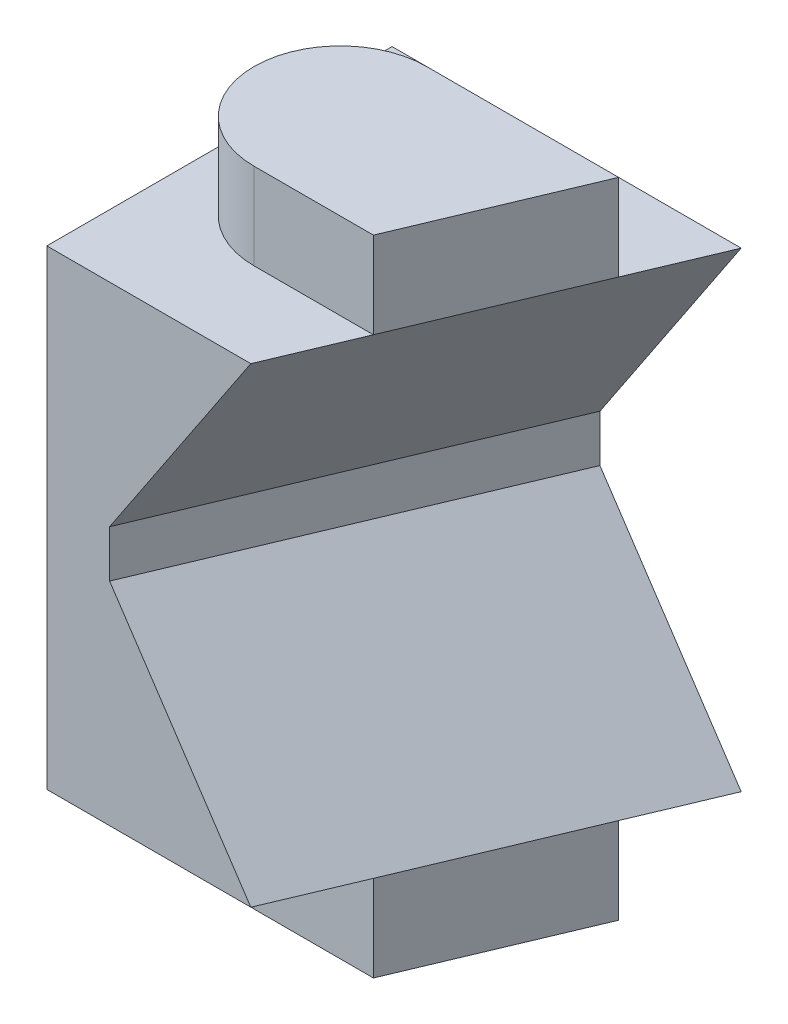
ISO-10303-21;
HEADER;
FILE_DESCRIPTION(('STEP AP214'),'2;1');
FILE_NAME('part.step','',(''),(''),'','','');
FILE_SCHEMA(('AUTOMOTIVE_DESIGN { 1 0 10303 214 1 1 1 1 }'));
ENDSEC;
DATA;
#1=APPLICATION_CONTEXT('core data for automotive mechanical design processes');
#2=APPLICATION_PROTOCOL_DEFINITION('international standard','automotive_design',2000,#1);
#3=PRODUCT_CONTEXT('',#1,'mechanical');
#4=PRODUCT('Part','Part','',(#3));
#5=PRODUCT_RELATED_PRODUCT_CATEGORY('part','',(#4));
#6=PRODUCT_DEFINITION_FORMATION('','',#4);
#7=PRODUCT_DEFINITION_CONTEXT('part definition',#1,'design');
#8=PRODUCT_DEFINITION('design','',#6,#7);
#9=PRODUCT_DEFINITION_SHAPE('','',#8);
#10=(LENGTH_UNIT() NAMED_UNIT(*) SI_UNIT(.MILLI.,.METRE.));
#11=(NAMED_UNIT(*) PLANE_ANGLE_UNIT() SI_UNIT($,.RADIAN.));
#12=(NAMED_UNIT(*) SI_UNIT($,.STERADIAN.) SOLID_ANGLE_UNIT());
#13=UNCERTAINTY_MEASURE_WITH_UNIT(LENGTH_MEASURE(1.E-05),#10,'distance_accuracy_value','');
#14=(GEOMETRIC_REPRESENTATION_CONTEXT(3) GLOBAL_UNCERTAINTY_ASSIGNED_CONTEXT((#13)) GLOBAL_UNIT_ASSIGNED_CONTEXT((#10,
#11,#12)) REPRESENTATION_CONTEXT('',''));
#15=CARTESIAN_POINT('',(0.,0.,0.));
#16=DIRECTION('',(0.,0.,1.));
#17=DIRECTION('',(1.,0.,0.));
#18=AXIS2_PLACEMENT_3D('',#15,#16,#17);
#19=CARTESIAN_POINT('',(12.9999999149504,-15.0000000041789,22.0000000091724));
#20=DIRECTION('',(0.785395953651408,0.523597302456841,0.330150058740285));
#21=DIRECTION('',(-0.554700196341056,0.832050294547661,-4.39613269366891E-13));
#22=AXIS2_PLACEMENT_3D('',#19,#20,#21);
#23=PLANE('',#22);
#24=CARTESIAN_POINT('',(12.9999999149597,-15.0000000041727,22.0000000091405));
#25=CARTESIAN_POINT('',(3.99999991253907,-1.50000000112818,22.0000000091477));
#26=B_SPLINE_CURVE_WITH_KNOTS('',1,(#24,#25),.UNSPECIFIED.,.F.,.F.,(2,2),(0.,1.),.UNSPECIFIED.);
#27=CARTESIAN_POINT('',(12.9999999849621,-15.0000000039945,21.9999998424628));
#28=VERTEX_POINT('',#27);
#29=CARTESIAN_POINT('',(4.00000000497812,-1.5000001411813,22.0000000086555));
#30=VERTEX_POINT('',#29);
#31=EDGE_CURVE('E235',#28,#30,#26,.T.);
#32=ORIENTED_EDGE('',*,*,#31,.F.);
#33=CARTESIAN_POINT('',(15.3119870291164,-15.0000000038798,16.5000000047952));
#34=CARTESIAN_POINT('',(12.9999999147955,-15.0000000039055,22.0000000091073));
#35=B_SPLINE_CURVE_WITH_KNOTS('',1,(#33,#34),.UNSPECIFIED.,.F.,.F.,(2,2),(0.,1.),.UNSPECIFIED.);
#36=CARTESIAN_POINT('',(15.3119870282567,-15.0000000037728,16.5000000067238));
#37=VERTEX_POINT('',#36);
#38=EDGE_CURVE('E183',#37,#28,#35,.T.);
#39=ORIENTED_EDGE('',*,*,#38,.F.);
#40=CARTESIAN_POINT('',(19.935961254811,-15.0000000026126,5.50000000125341));
#41=CARTESIAN_POINT('',(15.3119870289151,-15.0000000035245,16.5000000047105));
#42=B_SPLINE_CURVE_WITH_KNOTS('',1,(#40,#41),.UNSPECIFIED.,.F.,.F.,(2,2),(0.,1.),.UNSPECIFIED.);
#43=CARTESIAN_POINT('',(19.935961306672,-15.0000000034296,5.49999987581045));
#44=VERTEX_POINT('',#43);
#45=EDGE_CURVE('E214',#44,#37,#42,.T.);
#46=ORIENTED_EDGE('',*,*,#45,.F.);
#47=CARTESIAN_POINT('',(22.2479483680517,-15.0000000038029,1.43913809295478E-09));
#48=CARTESIAN_POINT('',(19.9359612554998,-15.0000000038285,5.50000000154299));
#49=B_SPLINE_CURVE_WITH_KNOTS('',1,(#47,#48),.UNSPECIFIED.,.F.,.F.,(2,2),(0.,1.),.UNSPECIFIED.);
#50=CARTESIAN_POINT('',(22.2479483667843,-15.0000000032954,4.64677502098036E-10));
#51=VERTEX_POINT('',#50);
#52=EDGE_CURVE('E33',#51,#44,#49,.T.);
#53=ORIENTED_EDGE('',*,*,#52,.F.);
#54=CARTESIAN_POINT('',(22.2479483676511,-15.0000000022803,-2.25523637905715E-11));
#55=CARTESIAN_POINT('',(13.2479483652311,-1.49999999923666,-1.54204042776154E-11));
#56=B_SPLINE_CURVE_WITH_KNOTS('',1,(#54,#55),.UNSPECIFIED.,.F.,.F.,(2,2),(0.,1.),.UNSPECIFIED.);
#57=CARTESIAN_POINT('',(13.2479483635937,-1.49999969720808,-9.59917629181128E-12));
#58=VERTEX_POINT('',#57);
#59=EDGE_CURVE('E240',#51,#58,#56,.T.);
#60=ORIENTED_EDGE('',*,*,#59,.T.);
#61=CARTESIAN_POINT('',(13.2479483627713,-1.49999999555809,2.04458569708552E-12));
#62=CARTESIAN_POINT('',(3.99999990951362,-1.49999999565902,22.0000000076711));
#63=B_SPLINE_CURVE_WITH_KNOTS('',1,(#61,#62),.UNSPECIFIED.,.F.,.F.,(2,2),(0.,1.),.UNSPECIFIED.);
#64=EDGE_CURVE('E233',#58,#30,#63,.T.);
#65=ORIENTED_EDGE('',*,*,#64,.T.);
#66=EDGE_LOOP('',(#32,#39,#46,#53,#60,#65));
#67=FACE_BOUND('',#66,.T.);
#68=ADVANCED_FACE('F14',(#67),#23,.T.);
#69=CARTESIAN_POINT('',(22.2479483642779,15.0000000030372,-7.48755097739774E-12));
#70=DIRECTION('',(0.785395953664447,-0.523597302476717,0.330150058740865));
#71=DIRECTION('',(0.554700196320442,0.83205029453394,-4.79190809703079E-13));
#72=AXIS2_PLACEMENT_3D('',#69,#70,#71);
#73=PLANE('',#72);
#74=CARTESIAN_POINT('',(19.9359612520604,15.0000000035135,5.50000000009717));
#75=CARTESIAN_POINT('',(22.2479483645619,15.0000000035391,1.12945883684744E-10));
#76=B_SPLINE_CURVE_WITH_KNOTS('',1,(#74,#75),.UNSPECIFIED.,.F.,.F.,(2,2),(0.,1.),.UNSPECIFIED.);
#77=CARTESIAN_POINT('',(19.9359611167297,15.0000000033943,5.5000000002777));
#78=VERTEX_POINT('',#77);
#79=CARTESIAN_POINT('',(22.2479482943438,15.0000000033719,1.66700320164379E-07));
#80=VERTEX_POINT('',#79);
#81=EDGE_CURVE('E109',#78,#80,#76,.T.);
#82=ORIENTED_EDGE('',*,*,#81,.F.);
#83=CARTESIAN_POINT('',(19.9359612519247,15.000000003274,5.50000000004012));
#84=CARTESIAN_POINT('',(15.3119870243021,15.0000000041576,16.5000000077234));
#85=B_SPLINE_CURVE_WITH_KNOTS('',1,(#83,#84),.UNSPECIFIED.,.F.,.F.,(2,2),(0.,1.),.UNSPECIFIED.);
#86=CARTESIAN_POINT('',(15.3119869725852,15.0000000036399,16.5000001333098));
#87=VERTEX_POINT('',#86);
#88=EDGE_CURVE('E102',#78,#87,#85,.T.);
#89=ORIENTED_EDGE('',*,*,#88,.T.);
#90=CARTESIAN_POINT('',(12.9999999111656,15.0000000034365,22.0000000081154));
#91=CARTESIAN_POINT('',(15.3119870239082,15.0000000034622,16.5000000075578));
#92=B_SPLINE_CURVE_WITH_KNOTS('',1,(#90,#91),.UNSPECIFIED.,.F.,.F.,(2,2),(0.,1.),.UNSPECIFIED.);
#93=CARTESIAN_POINT('',(12.9999999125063,15.0000000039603,22.0000000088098));
#94=VERTEX_POINT('',#93);
#95=EDGE_CURVE('E106',#94,#87,#92,.T.);
#96=ORIENTED_EDGE('',*,*,#95,.F.);
#97=CARTESIAN_POINT('',(12.9999999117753,15.0000000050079,22.0000000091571));
#98=CARTESIAN_POINT('',(3.99999990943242,1.50000000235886,22.0000000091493));
#99=B_SPLINE_CURVE_WITH_KNOTS('',1,(#97,#98),.UNSPECIFIED.,.F.,.F.,(2,2),(0.,1.),.UNSPECIFIED.);
#100=CARTESIAN_POINT('',(3.99999990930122,1.50000000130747,22.0000000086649));
#101=VERTEX_POINT('',#100);
#102=EDGE_CURVE('E263',#94,#101,#99,.T.);
#103=ORIENTED_EDGE('',*,*,#102,.T.);
#104=CARTESIAN_POINT('',(3.99999990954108,1.50000000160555,22.000000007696));
#105=CARTESIAN_POINT('',(13.2479483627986,1.50000000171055,2.74570762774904E-11));
#106=B_SPLINE_CURVE_WITH_KNOTS('',1,(#104,#105),.UNSPECIFIED.,.F.,.F.,(2,2),(0.,1.),.UNSPECIFIED.);
#107=CARTESIAN_POINT('',(13.2479485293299,1.50000025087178,0.));
#108=VERTEX_POINT('',#107);
#109=EDGE_CURVE('E155',#101,#108,#106,.T.);
#110=ORIENTED_EDGE('',*,*,#109,.T.);
#111=CARTESIAN_POINT('',(22.2479483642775,15.0000000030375,-5.99272950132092E-12));
#112=CARTESIAN_POINT('',(13.2479483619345,1.50000000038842,-1.37656614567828E-11));
#113=B_SPLINE_CURVE_WITH_KNOTS('',1,(#111,#112),.UNSPECIFIED.,.F.,.F.,(2,2),(0.,1.),.UNSPECIFIED.);
#114=EDGE_CURVE('E319',#80,#108,#113,.T.);
#115=ORIENTED_EDGE('',*,*,#114,.F.);
#116=EDGE_LOOP('',(#82,#89,#96,#103,#110,#115));
#117=FACE_BOUND('',#116,.T.);
#118=ADVANCED_FACE('F104',(#117),#73,.T.);
#119=CARTESIAN_POINT('',(7.70193844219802,20.5000000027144,11.0000000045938));
#120=DIRECTION('',(-1.24066867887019E-11,-1.,-5.52071956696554E-13));
#121=DIRECTION('',(1.,-1.24066867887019E-11,0.));
#122=AXIS2_PLACEMENT_3D('',#119,#120,#121);
#123=CYLINDRICAL_SURFACE('',#122,5.50000000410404);
#124=CARTESIAN_POINT('',(7.70193844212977,15.0000000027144,11.0000000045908));
#125=DIRECTION('',(-1.24066867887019E-11,-1.,-5.52071956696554E-13));
#126=DIRECTION('',(1.,-1.24066867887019E-11,0.));
#127=AXIS2_PLACEMENT_3D('',#124,#125,#126);
#128=CIRCLE('',#127,5.50000000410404);
#129=CARTESIAN_POINT('',(7.70193844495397,15.000000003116,16.5000000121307));
#130=VERTEX_POINT('',#129);
#131=CARTESIAN_POINT('',(7.70193844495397,15.0000000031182,5.50000000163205));
#132=VERTEX_POINT('',#131);
#133=EDGE_CURVE('E18',#130,#132,#128,.T.);
#134=ORIENTED_EDGE('',*,*,#133,.F.);
#135=DIRECTION('',(-1.24066867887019E-11,-1.,-5.52071956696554E-13));
#136=VECTOR('',#135,1.);
#137=CARTESIAN_POINT('',(7.70193844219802,20.5000000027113,16.5000000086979));
#138=LINE('',#137,#136);
#139=CARTESIAN_POINT('',(7.70193844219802,20.5000000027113,16.5000000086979));
#140=VERTEX_POINT('',#139);
#141=EDGE_CURVE('E133',#140,#130,#138,.T.);
#142=ORIENTED_EDGE('',*,*,#141,.F.);
#143=CARTESIAN_POINT('',(7.70193844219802,20.5000000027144,11.0000000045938));
#144=DIRECTION('',(-1.24066867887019E-11,-1.,-5.52071956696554E-13));
#145=DIRECTION('',(1.,-1.24066867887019E-11,0.));
#146=AXIS2_PLACEMENT_3D('',#143,#144,#145);
#147=CIRCLE('',#146,5.50000000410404);
#148=CARTESIAN_POINT('',(7.70193844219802,20.5000000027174,5.50000000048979));
#149=VERTEX_POINT('',#148);
#150=EDGE_CURVE('E162',#140,#149,#147,.T.);
#151=ORIENTED_EDGE('',*,*,#150,.T.);
#152=DIRECTION('',(-1.24066867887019E-11,-1.,-5.52071956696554E-13));
#153=VECTOR('',#152,1.);
#154=CARTESIAN_POINT('',(7.70193844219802,20.5000000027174,5.50000000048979));
#155=LINE('',#154,#153);
#156=EDGE_CURVE('E167',#149,#132,#155,.T.);
#157=ORIENTED_EDGE('',*,*,#156,.T.);
#158=EDGE_LOOP('',(#134,#142,#151,#157));
#159=FACE_BOUND('',#158,.T.);
#160=ADVANCED_FACE('F422',(#159),#123,.T.);
#161=CARTESIAN_POINT('',(7.70193844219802,20.5000000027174,5.50000000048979));
#162=DIRECTION('',(0.,5.52071956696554E-13,-1.));
#163=DIRECTION('',(0.,1.,5.52071956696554E-13));
#164=AXIS2_PLACEMENT_3D('',#161,#162,#163);
#165=PLANE('',#164);
#166=CARTESIAN_POINT('',(7.70193844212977,15.0000000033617,5.50000000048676));
#167=CARTESIAN_POINT('',(19.9359612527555,15.0000000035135,5.50000000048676));
#168=B_SPLINE_CURVE_WITH_KNOTS('',1,(#166,#167),.UNSPECIFIED.,.F.,.F.,(2,2),(0.,1.),.UNSPECIFIED.);
#169=EDGE_CURVE('E136',#132,#78,#168,.T.);
#170=ORIENTED_EDGE('',*,*,#169,.F.);
#171=ORIENTED_EDGE('',*,*,#156,.F.);
#172=DIRECTION('',(1.,-1.2406638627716E-11,0.));
#173=VECTOR('',#172,1.);
#174=CARTESIAN_POINT('',(7.70193844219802,20.5000000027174,5.50000000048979));
#175=LINE('',#174,#173);
#176=CARTESIAN_POINT('',(19.9359612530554,20.5000000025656,5.50000000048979));
#177=VERTEX_POINT('',#176);
#178=EDGE_CURVE('E168',#149,#177,#175,.T.);
#179=ORIENTED_EDGE('',*,*,#178,.T.);
#180=DIRECTION('',(-1.24066867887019E-11,-1.,-5.52071956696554E-13));
#181=VECTOR('',#180,1.);
#182=CARTESIAN_POINT('',(19.9359612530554,20.5000000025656,5.50000000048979));
#183=LINE('',#182,#181);
#184=EDGE_CURVE('E170',#177,#78,#183,.T.);
#185=ORIENTED_EDGE('',*,*,#184,.T.);
#186=EDGE_LOOP('',(#170,#171,#179,#185));
#187=FACE_BOUND('',#186,.T.);
#188=ADVANCED_FACE('F464',(#187),#165,.T.);
#189=CARTESIAN_POINT('',(15.3119870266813,20.500000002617,16.5000000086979));
#190=DIRECTION('',(0.921863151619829,-1.16512038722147E-11,0.387515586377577));
#191=DIRECTION('',(0.387515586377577,0.,-0.921863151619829));
#192=AXIS2_PLACEMENT_3D('',#189,#190,#191);
#193=PLANE('',#192);
#194=ORIENTED_EDGE('',*,*,#88,.F.);
#195=ORIENTED_EDGE('',*,*,#184,.F.);
#196=DIRECTION('',(-0.387515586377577,4.29873490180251E-12,0.921863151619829));
#197=VECTOR('',#196,1.);
#198=CARTESIAN_POINT('',(15.3119870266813,20.500000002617,16.5000000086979));
#199=LINE('',#198,#197);
#200=CARTESIAN_POINT('',(15.3119870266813,20.500000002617,16.5000000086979));
#201=VERTEX_POINT('',#200);
#202=EDGE_CURVE('E127',#177,#201,#199,.T.);
#203=ORIENTED_EDGE('',*,*,#202,.T.);
#204=DIRECTION('',(-1.24066867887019E-11,-1.,-5.52071956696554E-13));
#205=VECTOR('',#204,1.);
#206=CARTESIAN_POINT('',(15.3119870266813,20.500000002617,16.5000000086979));
#207=LINE('',#206,#205);
#208=EDGE_CURVE('E124',#201,#87,#207,.T.);
#209=ORIENTED_EDGE('',*,*,#208,.T.);
#210=EDGE_LOOP('',(#194,#195,#203,#209));
#211=FACE_BOUND('',#210,.T.);
#212=ADVANCED_FACE('F125',(#211),#193,.T.);
#213=CARTESIAN_POINT('',(7.70193844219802,20.5000000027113,16.5000000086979));
#214=DIRECTION('',(0.,-5.5207195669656E-13,1.));
#215=DIRECTION('',(0.,-1.,-5.5207195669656E-13));
#216=AXIS2_PLACEMENT_3D('',#213,#214,#215);
#217=PLANE('',#216);
#218=CARTESIAN_POINT('',(15.3119870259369,15.0000000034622,16.5000000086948));
#219=CARTESIAN_POINT('',(7.70193844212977,15.0000000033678,16.5000000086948));
#220=B_SPLINE_CURVE_WITH_KNOTS('',1,(#218,#219),.UNSPECIFIED.,.F.,.F.,(2,2),(0.,1.),.UNSPECIFIED.);
#221=EDGE_CURVE('E118',#87,#130,#220,.T.);
#222=ORIENTED_EDGE('',*,*,#221,.F.);
#223=ORIENTED_EDGE('',*,*,#208,.F.);
#224=DIRECTION('',(-1.,1.24067269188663E-11,0.));
#225=VECTOR('',#224,1.);
#226=CARTESIAN_POINT('',(7.70193844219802,20.5000000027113,16.5000000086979));
#227=LINE('',#226,#225);
#228=EDGE_CURVE('E113',#201,#140,#227,.T.);
#229=ORIENTED_EDGE('',*,*,#228,.T.);
#230=ORIENTED_EDGE('',*,*,#141,.T.);
#231=EDGE_LOOP('',(#222,#223,#229,#230));
#232=FACE_BOUND('',#231,.T.);
#233=ADVANCED_FACE('F132',(#232),#217,.T.);
#234=CARTESIAN_POINT('',(7.70193844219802,20.5000000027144,11.0000000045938));
#235=DIRECTION('',(1.24066867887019E-11,1.,5.52071956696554E-13));
#236=DIRECTION('',(1.,-1.24066867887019E-11,0.));
#237=AXIS2_PLACEMENT_3D('',#234,#235,#236);
#238=PLANE('',#237);
#239=ORIENTED_EDGE('',*,*,#150,.F.);
#240=ORIENTED_EDGE('',*,*,#228,.F.);
#241=ORIENTED_EDGE('',*,*,#202,.F.);
#242=ORIENTED_EDGE('',*,*,#178,.F.);
#243=EDGE_LOOP('',(#239,#240,#241,#242));
#244=FACE_BOUND('',#243,.T.);
#245=ADVANCED_FACE('F16',(#244),#238,.T.);
#246=CARTESIAN_POINT('',(1.99999991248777,15.0000000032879,-6.71425375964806E-12));
#247=DIRECTION('',(-1.24066867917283E-11,1.00000000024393,-5.52071956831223E-13));
#248=DIRECTION('',(0.,-5.52016445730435E-13,1.00000000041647));
#249=AXIS2_PLACEMENT_3D('',#246,#247,#248);
#250=PLANE('',#249);
#251=CARTESIAN_POINT('',(12.999999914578,15.0000000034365,22.0000000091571));
#252=CARTESIAN_POINT('',(-8.35194274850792E-08,15.0000000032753,22.0000000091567));
#253=B_SPLINE_CURVE_WITH_KNOTS('',1,(#251,#252),.UNSPECIFIED.,.F.,.F.,(2,2),(0.,1.),.UNSPECIFIED.);
#254=CARTESIAN_POINT('',(8.31472217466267E-08,15.0000000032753,22.0000000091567));
#255=VERTEX_POINT('',#254);
#256=EDGE_CURVE('E121',#94,#255,#253,.T.);
#257=ORIENTED_EDGE('',*,*,#256,.F.);
#258=ORIENTED_EDGE('',*,*,#95,.T.);
#259=ORIENTED_EDGE('',*,*,#221,.T.);
#260=ORIENTED_EDGE('',*,*,#133,.T.);
#261=ORIENTED_EDGE('',*,*,#169,.T.);
#262=ORIENTED_EDGE('',*,*,#81,.T.);
#263=CARTESIAN_POINT('',(22.2479483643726,15.0000000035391,-5.99272950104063E-12));
#264=CARTESIAN_POINT('',(-8.35194274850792E-08,15.0000000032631,-6.78552263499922E-12));
#265=B_SPLINE_CURVE_WITH_KNOTS('',1,(#263,#264),.UNSPECIFIED.,.F.,.F.,(2,2),(0.,1.),.UNSPECIFIED.);
#266=CARTESIAN_POINT('',(-8.35194274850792E-08,15.0000000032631,-6.77624178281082E-12));
#267=VERTEX_POINT('',#266);
#268=EDGE_CURVE('E311',#80,#267,#265,.T.);
#269=ORIENTED_EDGE('',*,*,#268,.T.);
#270=DIRECTION('',(0.,-5.52036320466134E-13,-1.));
#271=VECTOR('',#270,1.);
#272=CARTESIAN_POINT('',(-8.35194274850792E-08,15.0000000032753,22.0000000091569));
#273=LINE('',#272,#271);
#274=EDGE_CURVE('E306',#255,#267,#273,.T.);
#275=ORIENTED_EDGE('',*,*,#274,.F.);
#276=EDGE_LOOP('',(#257,#258,#259,#260,#261,#262,#269,#275));
#277=FACE_BOUND('',#276,.T.);
#278=ADVANCED_FACE('F116',(#277),#250,.T.);
#279=CARTESIAN_POINT('',(13.2479483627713,-1.50000000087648,2.04384873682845E-12));
#280=DIRECTION('',(-0.921863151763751,1.1651633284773E-11,-0.387515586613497));
#281=DIRECTION('',(-0.387515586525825,4.2988952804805E-12,0.921863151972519));
#282=AXIS2_PLACEMENT_3D('',#279,#280,#281);
#283=PLANE('',#282);
#284=CARTESIAN_POINT('',(3.99999990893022,1.499999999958,22.0000000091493));
#285=CARTESIAN_POINT('',(3.99999990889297,-1.50000000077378,22.0000000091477));
#286=B_SPLINE_CURVE_WITH_KNOTS('',1,(#284,#285),.UNSPECIFIED.,.F.,.F.,(2,2),(0.,1.),.UNSPECIFIED.);
#287=EDGE_CURVE('E256',#101,#30,#286,.T.);
#288=ORIENTED_EDGE('',*,*,#287,.T.);
#289=ORIENTED_EDGE('',*,*,#64,.F.);
#290=CARTESIAN_POINT('',(13.2479483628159,1.49999999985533,-1.37656614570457E-11));
#291=CARTESIAN_POINT('',(13.2479483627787,-1.50000000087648,-1.54217107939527E-11));
#292=B_SPLINE_CURVE_WITH_KNOTS('',1,(#290,#291),.UNSPECIFIED.,.F.,.F.,(2,2),(0.,1.),.UNSPECIFIED.);
#293=EDGE_CURVE('E291',#108,#58,#292,.T.);
#294=ORIENTED_EDGE('',*,*,#293,.F.);
#295=ORIENTED_EDGE('',*,*,#109,.F.);
#296=EDGE_LOOP('',(#288,#289,#294,#295));
#297=FACE_BOUND('',#296,.T.);
#298=ADVANCED_FACE('F381',(#297),#283,.F.);
#299=CARTESIAN_POINT('',(1.99999991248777,15.0000000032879,-6.71425375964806E-12));
#300=DIRECTION('',(0.,5.52016445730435E-13,-1.00000000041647));
#301=DIRECTION('',(-1.00000000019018,1.24070198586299E-11,0.));
#302=AXIS2_PLACEMENT_3D('',#299,#300,#301);
#303=PLANE('',#302);
#304=CARTESIAN_POINT('',(22.2479483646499,-15.0000000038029,-2.25532228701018E-11));
#305=CARTESIAN_POINT('',(-8.31472252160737E-08,-15.0000000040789,-2.3346016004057E-11));
#306=B_SPLINE_CURVE_WITH_KNOTS('',1,(#304,#305),.UNSPECIFIED.,.F.,.F.,(2,2),(0.,1.),.UNSPECIFIED.);
#307=CARTESIAN_POINT('',(8.35194240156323E-08,-15.0000000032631,-1.22781768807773E-11));
#308=VERTEX_POINT('',#307);
#309=EDGE_CURVE('E349',#51,#308,#306,.T.);
#310=ORIENTED_EDGE('',*,*,#309,.T.);
#311=CARTESIAN_POINT('',(-8.31472252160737E-08,-15.0000000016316,-2.33460160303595E-11));
#312=CARTESIAN_POINT('',(-8.35194274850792E-08,15.0000000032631,-6.7855226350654E-12));
#313=B_SPLINE_CURVE_WITH_KNOTS('',1,(#311,#312),.UNSPECIFIED.,.F.,.F.,(2,2),(0.,1.),.UNSPECIFIED.);
#314=EDGE_CURVE('E264',#308,#267,#313,.T.);
#315=ORIENTED_EDGE('',*,*,#314,.T.);
#316=ORIENTED_EDGE('',*,*,#268,.F.);
#317=ORIENTED_EDGE('',*,*,#114,.T.);
#318=ORIENTED_EDGE('',*,*,#293,.T.);
#319=ORIENTED_EDGE('',*,*,#59,.F.);
#320=EDGE_LOOP('',(#310,#315,#316,#317,#318,#319));
#321=FACE_BOUND('',#320,.T.);
#322=ADVANCED_FACE('F348',(#321),#303,.T.);
#323=CARTESIAN_POINT('',(6.99999991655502,11.0999999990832,11.0000000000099));
#324=DIRECTION('',(1.,0.,0.));
#325=DIRECTION('',(0.,0.,-1.));
#326=AXIS2_PLACEMENT_3D('',#323,#324,#325);
#327=PLANE('',#326);
#328=CARTESIAN_POINT('',(6.99999991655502,8.99999999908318,11.0000000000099));
#329=DIRECTION('',(-1.,0.,0.));
#330=DIRECTION('',(0.,0.,1.));
#331=AXIS2_PLACEMENT_3D('',#328,#329,#330);
#332=CIRCLE('',#331,2.5);
#333=CARTESIAN_POINT('',(6.99999991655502,8.99999999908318,13.5000000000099));
#334=VERTEX_POINT('',#333);
#335=EDGE_CURVE('E284',#334,#334,#332,.T.);
#336=ORIENTED_EDGE('',*,*,#335,.T.);
#337=EDGE_LOOP('',(#336));
#338=FACE_BOUND('',#337,.T.);
#339=ADVANCED_FACE('F430',(#338),#327,.F.);
#340=CARTESIAN_POINT('',(-8.34449766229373E-08,8.99999999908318,11.0000000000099));
#341=DIRECTION('',(-1.,0.,0.));
#342=DIRECTION('',(0.,0.,1.));
#343=AXIS2_PLACEMENT_3D('',#340,#341,#342);
#344=CYLINDRICAL_SURFACE('',#343,2.5);
#345=ORIENTED_EDGE('',*,*,#335,.F.);
#346=EDGE_LOOP('',(#345));
#347=FACE_BOUND('',#346,.T.);
#348=CARTESIAN_POINT('',(0.399999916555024,8.99999999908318,11.0000000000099));
#349=DIRECTION('',(-1.,0.,0.));
#350=DIRECTION('',(0.,0.,1.));
#351=AXIS2_PLACEMENT_3D('',#348,#349,#350);
#352=CIRCLE('',#351,2.5);
#353=CARTESIAN_POINT('',(0.399999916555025,8.99999999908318,13.5000000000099));
#354=VERTEX_POINT('',#353);
#355=EDGE_CURVE('E290',#354,#354,#352,.T.);
#356=ORIENTED_EDGE('',*,*,#355,.T.);
#357=EDGE_LOOP('',(#356));
#358=FACE_BOUND('',#357,.T.);
#359=ADVANCED_FACE('F433',(#347,#358),#344,.F.);
#360=CARTESIAN_POINT('',(6.99999991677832,-6.90000000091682,11.0000000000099));
#361=DIRECTION('',(1.,0.,0.));
#362=DIRECTION('',(0.,0.,-1.));
#363=AXIS2_PLACEMENT_3D('',#360,#361,#362);
#364=PLANE('',#363);
#365=CARTESIAN_POINT('',(6.99999991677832,-9.00000000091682,11.0000000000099));
#366=DIRECTION('',(-1.,0.,0.));
#367=DIRECTION('',(0.,0.,1.));
#368=AXIS2_PLACEMENT_3D('',#365,#366,#367);
#369=CIRCLE('',#368,2.5);
#370=CARTESIAN_POINT('',(6.99999991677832,-9.00000000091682,13.5000000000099));
#371=VERTEX_POINT('',#370);
#372=EDGE_CURVE('E294',#371,#371,#369,.T.);
#373=ORIENTED_EDGE('',*,*,#372,.T.);
#374=EDGE_LOOP('',(#373));
#375=FACE_BOUND('',#374,.T.);
#376=ADVANCED_FACE('F437',(#375),#364,.F.);
#377=CARTESIAN_POINT('',(-8.32216760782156E-08,-9.00000000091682,11.0000000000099));
#378=DIRECTION('',(-1.,0.,0.));
#379=DIRECTION('',(0.,0.,1.));
#380=AXIS2_PLACEMENT_3D('',#377,#378,#379);
#381=CYLINDRICAL_SURFACE('',#380,2.5);
#382=ORIENTED_EDGE('',*,*,#372,.F.);
#383=EDGE_LOOP('',(#382));
#384=FACE_BOUND('',#383,.T.);
#385=CARTESIAN_POINT('',(0.399999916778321,-9.00000000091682,11.0000000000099));
#386=DIRECTION('',(-1.,0.,0.));
#387=DIRECTION('',(0.,0.,1.));
#388=AXIS2_PLACEMENT_3D('',#385,#386,#387);
#389=CIRCLE('',#388,2.5);
#390=CARTESIAN_POINT('',(0.399999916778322,-9.00000000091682,13.5000000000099));
#391=VERTEX_POINT('',#390);
#392=EDGE_CURVE('E297',#391,#391,#389,.T.);
#393=ORIENTED_EDGE('',*,*,#392,.T.);
#394=EDGE_LOOP('',(#393));
#395=FACE_BOUND('',#394,.T.);
#396=ADVANCED_FACE('F441',(#384,#395),#381,.F.);
#397=CARTESIAN_POINT('',(-8.31472252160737E-08,-15.0000000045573,22.0000000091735));
#398=DIRECTION('',(1.,1.24066867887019E-11,0.));
#399=DIRECTION('',(-1.24066867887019E-11,1.,0.));
#400=AXIS2_PLACEMENT_3D('',#397,#398,#399);
#401=PLANE('',#400);
#402=CARTESIAN_POINT('',(-8.34449766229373E-08,8.99999999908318,11.0000000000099));
#403=DIRECTION('',(-1.,0.,0.));
#404=DIRECTION('',(0.,0.,1.));
#405=AXIS2_PLACEMENT_3D('',#402,#403,#404);
#406=CIRCLE('',#405,2.9);
#407=CARTESIAN_POINT('',(-8.34449761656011E-08,8.99999999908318,13.9000000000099));
#408=VERTEX_POINT('',#407);
#409=EDGE_CURVE('E300',#408,#408,#406,.T.);
#410=ORIENTED_EDGE('',*,*,#409,.F.);
#411=EDGE_LOOP('',(#410));
#412=FACE_BOUND('',#411,.T.);
#413=CARTESIAN_POINT('',(-8.32216760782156E-08,-9.00000000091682,11.0000000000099));
#414=DIRECTION('',(-1.,0.,0.));
#415=DIRECTION('',(0.,0.,1.));
#416=AXIS2_PLACEMENT_3D('',#413,#414,#415);
#417=CIRCLE('',#416,2.9);
#418=CARTESIAN_POINT('',(-8.32216756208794E-08,-9.00000000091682,13.9000000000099));
#419=VERTEX_POINT('',#418);
#420=EDGE_CURVE('E303',#419,#419,#417,.T.);
#421=ORIENTED_EDGE('',*,*,#420,.F.);
#422=EDGE_LOOP('',(#421));
#423=FACE_BOUND('',#422,.T.);
#424=ORIENTED_EDGE('',*,*,#274,.T.);
#425=ORIENTED_EDGE('',*,*,#314,.F.);
#426=CARTESIAN_POINT('',(-8.31472252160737E-08,-15.0000000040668,22.0000000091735));
#427=CARTESIAN_POINT('',(-8.31472252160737E-08,-15.0000000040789,9.85750137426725E-12));
#428=B_SPLINE_CURVE_WITH_KNOTS('',1,(#426,#427),.UNSPECIFIED.,.F.,.F.,(2,2),(0.,1.),.UNSPECIFIED.);
#429=CARTESIAN_POINT('',(8.35194240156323E-08,-15.0000000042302,22.0000000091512));
#430=VERTEX_POINT('',#429);
#431=EDGE_CURVE('E350',#430,#308,#428,.T.);
#432=ORIENTED_EDGE('',*,*,#431,.F.);
#433=CARTESIAN_POINT('',(-8.31472252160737E-08,-15.0000000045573,22.0000000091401));
#434=CARTESIAN_POINT('',(-8.35194274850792E-08,15.0000000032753,22.0000000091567));
#435=B_SPLINE_CURVE_WITH_KNOTS('',1,(#433,#434),.UNSPECIFIED.,.F.,.F.,(2,2),(0.,1.),.UNSPECIFIED.);
#436=EDGE_CURVE('E241',#430,#255,#435,.T.);
#437=ORIENTED_EDGE('',*,*,#436,.T.);
#438=EDGE_LOOP('',(#424,#425,#432,#437));
#439=FACE_BOUND('',#438,.T.);
#440=ADVANCED_FACE('F342',(#412,#423,#439),#401,.F.);
#441=CARTESIAN_POINT('',(-8.34449766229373E-08,8.99999999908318,11.0000000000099));
#442=DIRECTION('',(-1.,0.,0.));
#443=DIRECTION('',(0.,0.,1.));
#444=AXIS2_PLACEMENT_3D('',#441,#442,#443);
#445=CONICAL_SURFACE('',#444,2.9,0.785398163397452);
#446=ORIENTED_EDGE('',*,*,#355,.F.);
#447=EDGE_LOOP('',(#446));
#448=FACE_BOUND('',#447,.T.);
#449=ORIENTED_EDGE('',*,*,#409,.T.);
#450=EDGE_LOOP('',(#449));
#451=FACE_BOUND('',#450,.T.);
#452=ADVANCED_FACE('F448',(#448,#451),#445,.F.);
#453=CARTESIAN_POINT('',(-8.32216760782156E-08,-9.00000000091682,11.0000000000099));
#454=DIRECTION('',(-1.,0.,0.));
#455=DIRECTION('',(0.,0.,1.));
#456=AXIS2_PLACEMENT_3D('',#453,#454,#455);
#457=CONICAL_SURFACE('',#456,2.9,0.785398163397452);
#458=ORIENTED_EDGE('',*,*,#392,.F.);
#459=EDGE_LOOP('',(#458));
#460=FACE_BOUND('',#459,.T.);
#461=ORIENTED_EDGE('',*,*,#420,.T.);
#462=EDGE_LOOP('',(#461));
#463=FACE_BOUND('',#462,.T.);
#464=ADVANCED_FACE('F429',(#460,#463),#457,.F.);
#465=CARTESIAN_POINT('',(12.999999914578,15.0000000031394,22.0000000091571));
#466=DIRECTION('',(0.,-5.52016445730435E-13,1.00000000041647));
#467=DIRECTION('',(1.00000000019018,-1.24070198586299E-11,0.));
#468=AXIS2_PLACEMENT_3D('',#465,#466,#467);
#469=PLANE('',#468);
#470=CARTESIAN_POINT('',(12.9999999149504,-15.0000000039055,22.0000000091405));
#471=CARTESIAN_POINT('',(-8.31472252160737E-08,-15.0000000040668,22.0000000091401));
#472=B_SPLINE_CURVE_WITH_KNOTS('',1,(#470,#471),.UNSPECIFIED.,.F.,.F.,(2,2),(0.,1.),.UNSPECIFIED.);
#473=EDGE_CURVE('E189',#28,#430,#472,.T.);
#474=ORIENTED_EDGE('',*,*,#473,.F.);
#475=ORIENTED_EDGE('',*,*,#31,.T.);
#476=ORIENTED_EDGE('',*,*,#287,.F.);
#477=ORIENTED_EDGE('',*,*,#102,.F.);
#478=ORIENTED_EDGE('',*,*,#256,.T.);
#479=ORIENTED_EDGE('',*,*,#436,.F.);
#480=EDGE_LOOP('',(#474,#475,#476,#477,#478,#479));
#481=FACE_BOUND('',#480,.T.);
#482=ADVANCED_FACE('F376',(#481),#469,.T.);
#483=CARTESIAN_POINT('',(7.70193844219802,-20.5000000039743,16.5000000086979));
#484=DIRECTION('',(0.,-5.5207195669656E-13,-1.));
#485=DIRECTION('',(0.,1.,-5.5207195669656E-13));
#486=AXIS2_PLACEMENT_3D('',#483,#484,#485);
#487=PLANE('',#486);
#488=CARTESIAN_POINT('',(15.3119870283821,-15.0000000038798,16.5000000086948));
#489=CARTESIAN_POINT('',(7.70193844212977,-15.0000000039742,16.5000000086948));
#490=B_SPLINE_CURVE_WITH_KNOTS('',1,(#488,#489),.UNSPECIFIED.,.F.,.F.,(2,2),(0.,1.),.UNSPECIFIED.);
#491=CARTESIAN_POINT('',(7.70193844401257,-15.0000000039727,16.5000000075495));
#492=VERTEX_POINT('',#491);
#493=EDGE_CURVE('E178',#37,#492,#490,.T.);
#494=ORIENTED_EDGE('',*,*,#493,.T.);
#495=DIRECTION('',(-1.24066867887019E-11,1.,-5.52071956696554E-13));
#496=VECTOR('',#495,1.);
#497=CARTESIAN_POINT('',(7.70193844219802,-20.5000000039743,16.5000000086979));
#498=LINE('',#497,#496);
#499=CARTESIAN_POINT('',(7.70193844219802,-20.5000000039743,16.5000000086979));
#500=VERTEX_POINT('',#499);
#501=EDGE_CURVE('E209',#500,#492,#498,.T.);
#502=ORIENTED_EDGE('',*,*,#501,.F.);
#503=DIRECTION('',(-1.,-1.24067269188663E-11,0.));
#504=VECTOR('',#503,1.);
#505=CARTESIAN_POINT('',(7.70193844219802,-20.5000000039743,16.5000000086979));
#506=LINE('',#505,#504);
#507=CARTESIAN_POINT('',(15.3119870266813,-20.5000000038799,16.5000000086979));
#508=VERTEX_POINT('',#507);
#509=EDGE_CURVE('E202',#508,#500,#506,.T.);
#510=ORIENTED_EDGE('',*,*,#509,.F.);
#511=DIRECTION('',(-1.24066867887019E-11,1.,-5.52071956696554E-13));
#512=VECTOR('',#511,1.);
#513=CARTESIAN_POINT('',(15.3119870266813,-20.5000000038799,16.5000000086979));
#514=LINE('',#513,#512);
#515=EDGE_CURVE('E208',#508,#37,#514,.T.);
#516=ORIENTED_EDGE('',*,*,#515,.T.);
#517=EDGE_LOOP('',(#494,#502,#510,#516));
#518=FACE_BOUND('',#517,.T.);
#519=ADVANCED_FACE('F396',(#518),#487,.F.);
#520=CARTESIAN_POINT('',(15.3119870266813,-20.5000000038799,16.5000000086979));
#521=DIRECTION('',(-0.921863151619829,-1.16512038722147E-11,-0.387515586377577));
#522=DIRECTION('',(-0.387515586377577,0.,0.921863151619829));
#523=AXIS2_PLACEMENT_3D('',#520,#521,#522);
#524=PLANE('',#523);
#525=ORIENTED_EDGE('',*,*,#45,.T.);
#526=ORIENTED_EDGE('',*,*,#515,.F.);
#527=DIRECTION('',(-0.387515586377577,-4.29873490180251E-12,0.921863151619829));
#528=VECTOR('',#527,1.);
#529=CARTESIAN_POINT('',(15.3119870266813,-20.5000000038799,16.5000000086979));
#530=LINE('',#529,#528);
#531=CARTESIAN_POINT('',(19.9359612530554,-20.5000000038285,5.50000000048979));
#532=VERTEX_POINT('',#531);
#533=EDGE_CURVE('E210',#532,#508,#530,.T.);
#534=ORIENTED_EDGE('',*,*,#533,.F.);
#535=DIRECTION('',(-1.24066867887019E-11,1.,-5.52071956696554E-13));
#536=VECTOR('',#535,1.);
#537=CARTESIAN_POINT('',(19.9359612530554,-20.5000000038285,5.50000000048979));
#538=LINE('',#537,#536);
#539=EDGE_CURVE('E213',#532,#44,#538,.T.);
#540=ORIENTED_EDGE('',*,*,#539,.T.);
#541=EDGE_LOOP('',(#525,#526,#534,#540));
#542=FACE_BOUND('',#541,.T.);
#543=ADVANCED_FACE('F403',(#542),#524,.F.);
#544=CARTESIAN_POINT('',(7.70193844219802,-20.5000000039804,5.50000000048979));
#545=DIRECTION('',(0.,5.52071956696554E-13,1.));
#546=DIRECTION('',(0.,-1.,5.52071956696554E-13));
#547=AXIS2_PLACEMENT_3D('',#544,#545,#546);
#548=PLANE('',#547);
#549=CARTESIAN_POINT('',(7.70193844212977,-15.0000000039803,5.50000000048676));
#550=CARTESIAN_POINT('',(19.9359612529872,-15.0000000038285,5.50000000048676));
#551=B_SPLINE_CURVE_WITH_KNOTS('',1,(#549,#550),.UNSPECIFIED.,.F.,.F.,(2,2),(0.,1.),.UNSPECIFIED.);
#552=CARTESIAN_POINT('',(7.70193844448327,-15.0000000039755,5.49999999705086));
#553=VERTEX_POINT('',#552);
#554=EDGE_CURVE('E9',#553,#44,#551,.T.);
#555=ORIENTED_EDGE('',*,*,#554,.T.);
#556=ORIENTED_EDGE('',*,*,#539,.F.);
#557=DIRECTION('',(1.,1.2406638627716E-11,0.));
#558=VECTOR('',#557,1.);
#559=CARTESIAN_POINT('',(7.70193844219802,-20.5000000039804,5.50000000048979));
#560=LINE('',#559,#558);
#561=CARTESIAN_POINT('',(7.70193844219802,-20.5000000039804,5.50000000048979));
#562=VERTEX_POINT('',#561);
#563=EDGE_CURVE('E215',#562,#532,#560,.T.);
#564=ORIENTED_EDGE('',*,*,#563,.F.);
#565=DIRECTION('',(-1.24066867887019E-11,1.,-5.52071956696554E-13));
#566=VECTOR('',#565,1.);
#567=CARTESIAN_POINT('',(7.70193844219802,-20.5000000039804,5.50000000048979));
#568=LINE('',#567,#566);
#569=EDGE_CURVE('E218',#562,#553,#568,.T.);
#570=ORIENTED_EDGE('',*,*,#569,.T.);
#571=EDGE_LOOP('',(#555,#556,#564,#570));
#572=FACE_BOUND('',#571,.T.);
#573=ADVANCED_FACE('F388',(#572),#548,.F.);
#574=CARTESIAN_POINT('',(7.70193844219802,-20.5000000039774,11.0000000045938));
#575=DIRECTION('',(-1.24066867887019E-11,1.,-5.52071956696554E-13));
#576=DIRECTION('',(-1.,-1.24066867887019E-11,0.));
#577=AXIS2_PLACEMENT_3D('',#574,#575,#576);
#578=CYLINDRICAL_SURFACE('',#577,5.50000000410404);
#579=CARTESIAN_POINT('',(7.70193844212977,-15.0000000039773,11.0000000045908));
#580=DIRECTION('',(-1.24066867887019E-11,1.,-5.52071956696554E-13));
#581=DIRECTION('',(-1.,-1.24066867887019E-11,0.));
#582=AXIS2_PLACEMENT_3D('',#579,#580,#581);
#583=CIRCLE('',#582,5.50000000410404);
#584=EDGE_CURVE('E24',#553,#492,#583,.T.);
#585=ORIENTED_EDGE('',*,*,#584,.F.);
#586=ORIENTED_EDGE('',*,*,#569,.F.);
#587=CARTESIAN_POINT('',(7.70193844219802,-20.5000000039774,11.0000000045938));
#588=DIRECTION('',(1.24066867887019E-11,-1.,5.52071956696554E-13));
#589=DIRECTION('',(1.,1.24066867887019E-11,0.));
#590=AXIS2_PLACEMENT_3D('',#587,#588,#589);
#591=CIRCLE('',#590,5.50000000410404);
#592=EDGE_CURVE('E219',#500,#562,#591,.T.);
#593=ORIENTED_EDGE('',*,*,#592,.F.);
#594=ORIENTED_EDGE('',*,*,#501,.T.);
#595=EDGE_LOOP('',(#585,#586,#593,#594));
#596=FACE_BOUND('',#595,.T.);
#597=ADVANCED_FACE('F394',(#596),#578,.T.);
#598=CARTESIAN_POINT('',(7.70193844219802,-20.5000000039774,11.0000000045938));
#599=DIRECTION('',(1.24066867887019E-11,-1.,5.52071956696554E-13));
#600=DIRECTION('',(1.,1.24066867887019E-11,0.));
#601=AXIS2_PLACEMENT_3D('',#598,#599,#600);
#602=PLANE('',#601);
#603=ORIENTED_EDGE('',*,*,#592,.T.);
#604=ORIENTED_EDGE('',*,*,#563,.T.);
#605=ORIENTED_EDGE('',*,*,#533,.T.);
#606=ORIENTED_EDGE('',*,*,#509,.T.);
#607=EDGE_LOOP('',(#603,#604,#605,#606));
#608=FACE_BOUND('',#607,.T.);
#609=ADVANCED_FACE('F400',(#608),#602,.T.);
#610=CARTESIAN_POINT('',(1.99999991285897,-15.000000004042,22.000000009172));
#611=DIRECTION('',(-1.24066867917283E-11,1.00000000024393,-5.52071956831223E-13));
#612=DIRECTION('',(0.,-5.52016445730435E-13,1.00000000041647));
#613=AXIS2_PLACEMENT_3D('',#610,#611,#612);
#614=PLANE('',#613);
#615=ORIENTED_EDGE('',*,*,#52,.T.);
#616=ORIENTED_EDGE('',*,*,#554,.F.);
#617=ORIENTED_EDGE('',*,*,#584,.T.);
#618=ORIENTED_EDGE('',*,*,#493,.F.);
#619=ORIENTED_EDGE('',*,*,#38,.T.);
#620=ORIENTED_EDGE('',*,*,#473,.T.);
#621=ORIENTED_EDGE('',*,*,#431,.T.);
#622=ORIENTED_EDGE('',*,*,#309,.F.);
#623=EDGE_LOOP('',(#615,#616,#617,#618,#619,#620,#621,#622));
#624=FACE_BOUND('',#623,.T.);
#625=ADVANCED_FACE('F373',(#624),#614,.F.);
#626=CLOSED_SHELL('',(#68,#118,#160,#188,#212,#233,#245,#278,#298,#322,#339,#359,#376,#396,#440,
#452,#464,#482,#519,#543,#573,#597,#609,#625));
#627=MANIFOLD_SOLID_BREP('B1',#626);
#628=ADVANCED_BREP_SHAPE_REPRESENTATION('',(#18,#627),#14);
#629=SHAPE_DEFINITION_REPRESENTATION(#9,#628);
ENDSEC;
END-ISO-10303-21;
